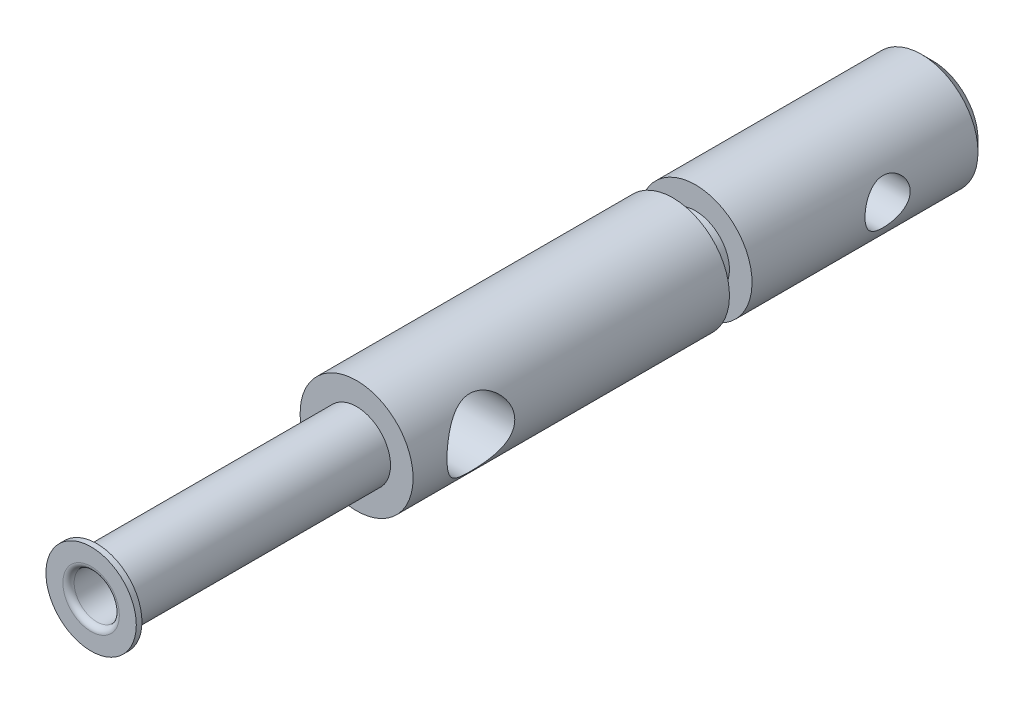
ISO-10303-21;
HEADER;
FILE_DESCRIPTION(('STEP AP214'),'2;1');
FILE_NAME('part.step','',(''),(''),'','','');
FILE_SCHEMA(('AUTOMOTIVE_DESIGN { 1 0 10303 214 1 1 1 1 }'));
ENDSEC;
DATA;
#1=APPLICATION_CONTEXT('core data for automotive mechanical design processes');
#2=APPLICATION_PROTOCOL_DEFINITION('international standard','automotive_design',2000,#1);
#3=PRODUCT_CONTEXT('',#1,'mechanical');
#4=PRODUCT('Part','Part','',(#3));
#5=PRODUCT_RELATED_PRODUCT_CATEGORY('part','',(#4));
#6=PRODUCT_DEFINITION_FORMATION('','',#4);
#7=PRODUCT_DEFINITION_CONTEXT('part definition',#1,'design');
#8=PRODUCT_DEFINITION('design','',#6,#7);
#9=PRODUCT_DEFINITION_SHAPE('','',#8);
#10=(LENGTH_UNIT() NAMED_UNIT(*) SI_UNIT(.MILLI.,.METRE.));
#11=(NAMED_UNIT(*) PLANE_ANGLE_UNIT() SI_UNIT($,.RADIAN.));
#12=(NAMED_UNIT(*) SI_UNIT($,.STERADIAN.) SOLID_ANGLE_UNIT());
#13=UNCERTAINTY_MEASURE_WITH_UNIT(LENGTH_MEASURE(1.E-05),#10,'distance_accuracy_value','');
#14=(GEOMETRIC_REPRESENTATION_CONTEXT(3) GLOBAL_UNCERTAINTY_ASSIGNED_CONTEXT((#13)) GLOBAL_UNIT_ASSIGNED_CONTEXT((#10,
#11,#12)) REPRESENTATION_CONTEXT('',''));
#15=CARTESIAN_POINT('',(0.,0.,0.));
#16=DIRECTION('',(0.,0.,1.));
#17=DIRECTION('',(1.,0.,0.));
#18=AXIS2_PLACEMENT_3D('',#15,#16,#17);
#19=CARTESIAN_POINT('',(0.,0.,51.));
#20=DIRECTION('',(0.,0.,-1.));
#21=DIRECTION('',(-1.,0.,0.));
#22=AXIS2_PLACEMENT_3D('',#19,#20,#21);
#23=CYLINDRICAL_SURFACE('',#22,5.);
#24=CARTESIAN_POINT('',(0.,0.,23.));
#25=DIRECTION('',(0.,0.,-1.));
#26=DIRECTION('',(0.,1.,0.));
#27=AXIS2_PLACEMENT_3D('',#24,#25,#26);
#28=CIRCLE('',#27,5.);
#29=CARTESIAN_POINT('',(0.,5.,23.));
#30=VERTEX_POINT('',#29);
#31=EDGE_CURVE('E181',#30,#30,#28,.T.);
#32=ORIENTED_EDGE('',*,*,#31,.F.);
#33=EDGE_LOOP('',(#32));
#34=FACE_BOUND('',#33,.T.);
#35=CARTESIAN_POINT('',(0.,0.,51.));
#36=DIRECTION('',(0.,0.,1.));
#37=DIRECTION('',(1.,0.,0.));
#38=AXIS2_PLACEMENT_3D('',#35,#36,#37);
#39=CIRCLE('',#38,5.);
#40=CARTESIAN_POINT('',(5.,0.,51.));
#41=VERTEX_POINT('',#40);
#42=EDGE_CURVE('E73',#41,#41,#39,.T.);
#43=ORIENTED_EDGE('',*,*,#42,.F.);
#44=EDGE_LOOP('',(#43));
#45=FACE_BOUND('',#44,.T.);
#46=CARTESIAN_POINT('',(5.,0.,42.));
#47=CARTESIAN_POINT('',(4.99999907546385,-0.076769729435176,42.0000010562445));
#48=CARTESIAN_POINT('',(4.99822567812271,-0.153562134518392,42.0029535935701));
#49=CARTESIAN_POINT('',(4.99118362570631,-0.30654848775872,42.0147142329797));
#50=CARTESIAN_POINT('',(4.98591292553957,-0.382742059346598,42.0235257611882));
#51=CARTESIAN_POINT('',(4.96499345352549,-0.609808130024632,42.0586485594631));
#52=CARTESIAN_POINT('',(4.94423772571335,-0.758981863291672,42.0936477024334));
#53=CARTESIAN_POINT('',(4.89123238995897,-1.04754167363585,42.1847727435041));
#54=CARTESIAN_POINT('',(4.8590397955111,-1.18697226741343,42.2407939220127));
#55=CARTESIAN_POINT('',(4.7859070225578,-1.45405042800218,42.371720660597));
#56=CARTESIAN_POINT('',(4.74496901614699,-1.58170090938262,42.4466215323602));
#57=CARTESIAN_POINT('',(4.65410731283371,-1.83260160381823,42.6195496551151));
#58=CARTESIAN_POINT('',(4.60373587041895,-1.95476885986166,42.7189073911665));
#59=CARTESIAN_POINT('',(4.50060875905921,-2.1817645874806,42.9349344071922));
#60=CARTESIAN_POINT('',(4.4478500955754,-2.28657046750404,43.0516258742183));
#61=CARTESIAN_POINT('',(4.33822134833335,-2.48890019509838,43.3158470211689));
#62=CARTESIAN_POINT('',(4.28164035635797,-2.58395539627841,43.4654035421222));
#63=CARTESIAN_POINT('',(4.17876602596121,-2.74722868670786,43.7816931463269));
#64=CARTESIAN_POINT('',(4.13245604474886,-2.81549033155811,43.9483977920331));
#65=CARTESIAN_POINT('',(4.06709259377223,-2.90881204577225,44.2531929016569));
#66=CARTESIAN_POINT('',(4.04415766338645,-2.94032394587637,44.3884719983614));
#67=CARTESIAN_POINT('',(4.01180616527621,-2.98432344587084,44.6636074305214));
#68=CARTESIAN_POINT('',(4.00237279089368,-2.99683469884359,44.803457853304));
#69=CARTESIAN_POINT('',(3.99841845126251,-3.0021101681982,45.0840229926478));
#70=CARTESIAN_POINT('',(4.00392674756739,-2.99483563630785,45.2247388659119));
#71=CARTESIAN_POINT('',(4.02906522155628,-2.96092124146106,45.5025575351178));
#72=CARTESIAN_POINT('',(4.04870602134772,-2.93426681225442,45.6396575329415));
#73=CARTESIAN_POINT('',(4.09906376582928,-2.86347831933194,45.9050605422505));
#74=CARTESIAN_POINT('',(4.12963433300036,-2.81957453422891,46.0334543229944));
#75=CARTESIAN_POINT('',(4.19854092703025,-2.71590167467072,46.2813897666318));
#76=CARTESIAN_POINT('',(4.23687979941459,-2.65612678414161,46.400928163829));
#77=CARTESIAN_POINT('',(4.32510698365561,-2.51035773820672,46.6499691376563));
#78=CARTESIAN_POINT('',(4.37584263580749,-2.42160671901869,46.7775599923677));
#79=CARTESIAN_POINT('',(4.47861022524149,-2.22582963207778,47.0173491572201));
#80=CARTESIAN_POINT('',(4.53064336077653,-2.11878609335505,47.1295325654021));
#81=CARTESIAN_POINT('',(4.63871766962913,-1.87159040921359,47.3512422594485));
#82=CARTESIAN_POINT('',(4.69430681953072,-1.72890315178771,47.4582193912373));
#83=CARTESIAN_POINT('',(4.77018325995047,-1.5006105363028,47.5992687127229));
#84=CARTESIAN_POINT('',(4.79423315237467,-1.42209821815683,47.6430641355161));
#85=CARTESIAN_POINT('',(4.83916496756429,-1.26074368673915,47.723718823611));
#86=CARTESIAN_POINT('',(4.86004883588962,-1.17790417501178,47.7605823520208));
#87=CARTESIAN_POINT('',(4.8968267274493,-1.01376371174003,47.8248114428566));
#88=CARTESIAN_POINT('',(4.91295100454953,-0.932690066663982,47.8526265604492));
#89=CARTESIAN_POINT('',(4.94139126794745,-0.767879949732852,47.9013339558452));
#90=CARTESIAN_POINT('',(4.95370938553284,-0.684144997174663,47.9222301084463));
#91=CARTESIAN_POINT('',(4.97416370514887,-0.514744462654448,47.9567718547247));
#92=CARTESIAN_POINT('',(4.98230296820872,-0.429080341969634,47.9704227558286));
#93=CARTESIAN_POINT('',(4.99415996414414,-0.256621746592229,47.9902661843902));
#94=CARTESIAN_POINT('',(4.99787831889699,-0.169827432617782,47.9964597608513));
#95=CARTESIAN_POINT('',(5.00179157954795,0.0673242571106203,48.0029926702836));
#96=CARTESIAN_POINT('',(4.99746512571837,0.218056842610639,47.9958115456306));
#97=CARTESIAN_POINT('',(4.97557955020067,0.515686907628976,47.9591544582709));
#98=CARTESIAN_POINT('',(4.95802069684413,0.662584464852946,47.9296789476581));
#99=CARTESIAN_POINT('',(4.91189447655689,0.945142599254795,47.8509115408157));
#100=CARTESIAN_POINT('',(4.88360514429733,1.08098954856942,47.802118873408));
#101=CARTESIAN_POINT('',(4.81827798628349,1.3425334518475,47.6866456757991));
#102=CARTESIAN_POINT('',(4.78123843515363,1.46822839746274,47.6199616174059));
#103=CARTESIAN_POINT('',(4.69690981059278,1.72001192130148,47.462885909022));
#104=CARTESIAN_POINT('',(4.64895602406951,1.84478813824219,47.3707523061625));
#105=CARTESIAN_POINT('',(4.54948534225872,2.0780522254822,47.1692172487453));
#106=CARTESIAN_POINT('',(4.49796434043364,2.18652085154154,47.0597957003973));
#107=CARTESIAN_POINT('',(4.38890846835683,2.39863988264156,46.8101792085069));
#108=CARTESIAN_POINT('',(4.33146483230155,2.4998203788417,46.667832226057));
#109=CARTESIAN_POINT('',(4.22432364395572,2.67690479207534,46.3655679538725));
#110=CARTESIAN_POINT('',(4.17461796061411,2.7528353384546,46.2056694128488));
#111=CARTESIAN_POINT('',(4.09969818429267,2.86285157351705,45.9075139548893));
#112=CARTESIAN_POINT('',(4.07151318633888,2.90243250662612,45.772039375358));
#113=CARTESIAN_POINT('',(4.02819211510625,2.96227327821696,45.4949358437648));
#114=CARTESIAN_POINT('',(4.01303795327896,2.98255990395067,45.3533157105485));
#115=CARTESIAN_POINT('',(3.99800893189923,3.00268261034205,45.0672461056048));
#116=CARTESIAN_POINT('',(3.99819152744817,3.00244179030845,44.9227880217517));
#117=CARTESIAN_POINT('',(4.01395435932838,2.98132945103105,44.6362111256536));
#118=CARTESIAN_POINT('',(4.02954296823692,2.96044671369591,44.4940936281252));
#119=CARTESIAN_POINT('',(4.07266369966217,2.90080351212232,44.2230231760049));
#120=CARTESIAN_POINT('',(4.09958421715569,2.86295284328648,44.0937658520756));
#121=CARTESIAN_POINT('',(4.1621100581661,2.77126473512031,43.8433254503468));
#122=CARTESIAN_POINT('',(4.19771865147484,2.71742127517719,43.722145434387));
#123=CARTESIAN_POINT('',(4.28025972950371,2.58578536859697,43.47136046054));
#124=CARTESIAN_POINT('',(4.32809142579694,2.50558518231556,43.3433184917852));
#125=CARTESIAN_POINT('',(4.42640286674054,2.32751213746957,43.1012391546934));
#126=CARTESIAN_POINT('',(4.47688476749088,2.22962472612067,42.9872134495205));
#127=CARTESIAN_POINT('',(4.5845123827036,2.00020353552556,42.7573011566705));
#128=CARTESIAN_POINT('',(4.64140045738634,1.86578571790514,42.6441501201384));
#129=CARTESIAN_POINT('',(4.74731429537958,1.57689277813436,42.4417920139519));
#130=CARTESIAN_POINT('',(4.79633723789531,1.42241049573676,42.3525935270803));
#131=CARTESIAN_POINT('',(4.85920558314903,1.18102189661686,42.2408755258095));
#132=CARTESIAN_POINT('',(4.87817139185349,1.10025014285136,42.2076640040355));
#133=CARTESIAN_POINT('',(4.91243413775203,0.935442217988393,42.1482278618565));
#134=CARTESIAN_POINT('',(4.9277332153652,0.851407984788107,42.1219991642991));
#135=CARTESIAN_POINT('',(4.95415527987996,0.681001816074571,42.0769905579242));
#136=CARTESIAN_POINT('',(4.9652904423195,0.594637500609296,42.0581889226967));
#137=CARTESIAN_POINT('',(4.98308318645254,0.420183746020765,42.028255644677));
#138=CARTESIAN_POINT('',(4.98974449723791,0.332095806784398,42.0171176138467));
#139=CARTESIAN_POINT('',(4.99603728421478,0.203123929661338,42.0066083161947));
#140=CARTESIAN_POINT('',(4.99752198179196,0.162556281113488,42.004131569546));
#141=CARTESIAN_POINT('',(4.99950360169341,0.0813278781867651,42.0008271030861));
#142=CARTESIAN_POINT('',(5.00000048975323,0.0406671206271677,41.9999994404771));
#143=CARTESIAN_POINT('',(5.,0.,42.));
#144=B_SPLINE_CURVE_WITH_KNOTS('',3,(#46,#47,#48,#49,#50,#51,#52,#53,#54,#55,#56,#57,#58,#59,
#60,#61,#62,#63,#64,#65,#66,#67,#68,#69,#70,#71,#72,#73,#74,#75,#76,#77,#78,#79,#80,#81,#82,#83,
#84,#85,#86,#87,#88,#89,#90,#91,#92,#93,#94,#95,#96,#97,#98,#99,#100,#101,#102,#103,#104,#105,
#106,#107,#108,#109,#110,#111,#112,#113,#114,#115,#116,#117,#118,#119,#120,#121,#122,#123,#124,
#125,#126,#127,#128,#129,#130,#131,#132,#133,#134,#135,#136,#137,#138,#139,#140,#141,#142,#143),
.UNSPECIFIED.,.T.,.F.,(4,2,2,2,2,2,2,2,2,2,2,2,2,2,2,2,2,2,2,2,2,2,2,2,2,2,2,2,2,2,2,2,2,2,2,2,
2,2,2,2,2,2,2,2,2,2,2,2,4),(0.,0.230263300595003,0.4606613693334,0.922002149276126,
1.38107466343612,1.84003329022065,2.33408870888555,2.8287820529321,3.38413315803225,
3.93857770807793,4.35913349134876,4.77916531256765,5.20002031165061,5.62119195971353,
6.03692224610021,6.45280509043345,6.94139679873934,7.43045779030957,7.98767605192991,
8.26653157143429,8.54521503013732,8.80648473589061,9.06760787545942,9.32853946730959,
9.58943435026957,10.0398406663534,10.490237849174,10.9296843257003,11.3692175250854,
11.8543559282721,12.3400624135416,12.889063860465,13.437484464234,13.8674843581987,
14.2968863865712,14.7278971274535,15.1591422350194,15.5696105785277,15.9802336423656,
16.4539008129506,16.927959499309,17.4794148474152,18.0310675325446,18.2988384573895,
18.5664526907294,18.8332781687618,19.0998809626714,19.221853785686,19.3438308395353),.UNSPECIFIED.);
#145=CARTESIAN_POINT('',(5.,0.,42.));
#146=VERTEX_POINT('',#145);
#147=EDGE_CURVE('E41',#146,#146,#144,.T.);
#148=ORIENTED_EDGE('',*,*,#147,.T.);
#149=EDGE_LOOP('',(#148));
#150=FACE_BOUND('',#149,.T.);
#151=CARTESIAN_POINT('',(-5.,0.,48.));
#152=CARTESIAN_POINT('',(-4.99999907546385,-0.0767697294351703,47.9999989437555));
#153=CARTESIAN_POINT('',(-4.99822567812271,-0.153562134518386,47.9970464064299));
#154=CARTESIAN_POINT('',(-4.99118362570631,-0.306548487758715,47.9852857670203));
#155=CARTESIAN_POINT('',(-4.98591292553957,-0.382742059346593,47.9764742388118));
#156=CARTESIAN_POINT('',(-4.96499345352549,-0.609808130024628,47.9413514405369));
#157=CARTESIAN_POINT('',(-4.94423772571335,-0.758981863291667,47.9063522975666));
#158=CARTESIAN_POINT('',(-4.89123238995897,-1.04754167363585,47.8152272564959));
#159=CARTESIAN_POINT('',(-4.8590397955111,-1.18697226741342,47.7592060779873));
#160=CARTESIAN_POINT('',(-4.7859070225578,-1.45405042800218,47.628279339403));
#161=CARTESIAN_POINT('',(-4.74496901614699,-1.58170090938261,47.5533784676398));
#162=CARTESIAN_POINT('',(-4.65410731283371,-1.83260160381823,47.3804503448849));
#163=CARTESIAN_POINT('',(-4.60373587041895,-1.95476885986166,47.2810926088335));
#164=CARTESIAN_POINT('',(-4.50060875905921,-2.1817645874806,47.0650655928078));
#165=CARTESIAN_POINT('',(-4.4478500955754,-2.28657046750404,46.9483741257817));
#166=CARTESIAN_POINT('',(-4.33822134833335,-2.48890019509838,46.6841529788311));
#167=CARTESIAN_POINT('',(-4.28164035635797,-2.5839553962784,46.5345964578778));
#168=CARTESIAN_POINT('',(-4.17876602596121,-2.74722868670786,46.2183068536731));
#169=CARTESIAN_POINT('',(-4.13245604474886,-2.81549033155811,46.0516022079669));
#170=CARTESIAN_POINT('',(-4.06709259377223,-2.90881204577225,45.7468070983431));
#171=CARTESIAN_POINT('',(-4.04415766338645,-2.94032394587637,45.6115280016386));
#172=CARTESIAN_POINT('',(-4.01180616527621,-2.98432344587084,45.3363925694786));
#173=CARTESIAN_POINT('',(-4.00237279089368,-2.99683469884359,45.196542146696));
#174=CARTESIAN_POINT('',(-3.99841845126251,-3.0021101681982,44.9159770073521));
#175=CARTESIAN_POINT('',(-4.00392674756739,-2.99483563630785,44.7752611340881));
#176=CARTESIAN_POINT('',(-4.02906522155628,-2.96092124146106,44.4974424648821));
#177=CARTESIAN_POINT('',(-4.04870602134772,-2.93426681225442,44.3603424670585));
#178=CARTESIAN_POINT('',(-4.09906376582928,-2.86347831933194,44.0949394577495));
#179=CARTESIAN_POINT('',(-4.12963433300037,-2.81957453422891,43.9665456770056));
#180=CARTESIAN_POINT('',(-4.19854092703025,-2.71590167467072,43.7186102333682));
#181=CARTESIAN_POINT('',(-4.23687979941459,-2.65612678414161,43.599071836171));
#182=CARTESIAN_POINT('',(-4.32510698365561,-2.51035773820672,43.3500308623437));
#183=CARTESIAN_POINT('',(-4.37584263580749,-2.42160671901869,43.2224400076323));
#184=CARTESIAN_POINT('',(-4.47861022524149,-2.22582963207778,42.9826508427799));
#185=CARTESIAN_POINT('',(-4.53064336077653,-2.11878609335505,42.8704674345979));
#186=CARTESIAN_POINT('',(-4.63871766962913,-1.87159040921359,42.6487577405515));
#187=CARTESIAN_POINT('',(-4.69430681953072,-1.72890315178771,42.5417806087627));
#188=CARTESIAN_POINT('',(-4.77018325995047,-1.5006105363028,42.4007312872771));
#189=CARTESIAN_POINT('',(-4.79423315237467,-1.42209821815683,42.3569358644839));
#190=CARTESIAN_POINT('',(-4.83916496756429,-1.26074368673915,42.276281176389));
#191=CARTESIAN_POINT('',(-4.86004883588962,-1.17790417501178,42.2394176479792));
#192=CARTESIAN_POINT('',(-4.8968267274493,-1.01376371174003,42.1751885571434));
#193=CARTESIAN_POINT('',(-4.91295100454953,-0.932690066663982,42.1473734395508));
#194=CARTESIAN_POINT('',(-4.94139126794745,-0.767879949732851,42.0986660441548));
#195=CARTESIAN_POINT('',(-4.95370938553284,-0.684144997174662,42.0777698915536));
#196=CARTESIAN_POINT('',(-4.97416370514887,-0.514744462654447,42.0432281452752));
#197=CARTESIAN_POINT('',(-4.98230296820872,-0.429080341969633,42.0295772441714));
#198=CARTESIAN_POINT('',(-4.99415996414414,-0.256621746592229,42.0097338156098));
#199=CARTESIAN_POINT('',(-4.99787831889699,-0.169827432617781,42.0035402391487));
#200=CARTESIAN_POINT('',(-5.00179157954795,0.0673242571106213,41.9970073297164));
#201=CARTESIAN_POINT('',(-4.99746512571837,0.21805684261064,42.0041884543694));
#202=CARTESIAN_POINT('',(-4.97557955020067,0.515686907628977,42.0408455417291));
#203=CARTESIAN_POINT('',(-4.95802069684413,0.662584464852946,42.0703210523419));
#204=CARTESIAN_POINT('',(-4.91189447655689,0.945142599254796,42.1490884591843));
#205=CARTESIAN_POINT('',(-4.88360514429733,1.08098954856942,42.197881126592));
#206=CARTESIAN_POINT('',(-4.81827798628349,1.34253345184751,42.3133543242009));
#207=CARTESIAN_POINT('',(-4.78123843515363,1.46822839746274,42.3800383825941));
#208=CARTESIAN_POINT('',(-4.69690981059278,1.72001192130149,42.537114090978));
#209=CARTESIAN_POINT('',(-4.64895602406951,1.84478813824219,42.6292476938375));
#210=CARTESIAN_POINT('',(-4.54948534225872,2.0780522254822,42.8307827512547));
#211=CARTESIAN_POINT('',(-4.49796434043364,2.18652085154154,42.9402042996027));
#212=CARTESIAN_POINT('',(-4.38890846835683,2.39863988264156,43.1898207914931));
#213=CARTESIAN_POINT('',(-4.33146483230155,2.4998203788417,43.332167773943));
#214=CARTESIAN_POINT('',(-4.22432364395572,2.67690479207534,43.6344320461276));
#215=CARTESIAN_POINT('',(-4.17461796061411,2.7528353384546,43.7943305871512));
#216=CARTESIAN_POINT('',(-4.09969818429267,2.86285157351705,44.0924860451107));
#217=CARTESIAN_POINT('',(-4.07151318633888,2.90243250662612,44.227960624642));
#218=CARTESIAN_POINT('',(-4.02819211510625,2.96227327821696,44.5050641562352));
#219=CARTESIAN_POINT('',(-4.01303795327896,2.98255990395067,44.6466842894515));
#220=CARTESIAN_POINT('',(-3.99800893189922,3.00268261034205,44.9327538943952));
#221=CARTESIAN_POINT('',(-3.99819152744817,3.00244179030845,45.0772119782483));
#222=CARTESIAN_POINT('',(-4.01395435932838,2.98132945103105,45.3637888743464));
#223=CARTESIAN_POINT('',(-4.02954296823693,2.96044671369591,45.5059063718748));
#224=CARTESIAN_POINT('',(-4.07266369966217,2.90080351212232,45.7769768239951));
#225=CARTESIAN_POINT('',(-4.0995842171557,2.86295284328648,45.9062341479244));
#226=CARTESIAN_POINT('',(-4.1621100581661,2.77126473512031,46.1566745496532));
#227=CARTESIAN_POINT('',(-4.19771865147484,2.71742127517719,46.277854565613));
#228=CARTESIAN_POINT('',(-4.28025972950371,2.58578536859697,46.52863953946));
#229=CARTESIAN_POINT('',(-4.32809142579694,2.50558518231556,46.6566815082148));
#230=CARTESIAN_POINT('',(-4.42640286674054,2.32751213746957,46.8987608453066));
#231=CARTESIAN_POINT('',(-4.47688476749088,2.22962472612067,47.0127865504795));
#232=CARTESIAN_POINT('',(-4.5845123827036,2.00020353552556,47.2426988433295));
#233=CARTESIAN_POINT('',(-4.64140045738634,1.86578571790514,47.3558498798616));
#234=CARTESIAN_POINT('',(-4.74731429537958,1.57689277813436,47.5582079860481));
#235=CARTESIAN_POINT('',(-4.79633723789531,1.42241049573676,47.6474064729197));
#236=CARTESIAN_POINT('',(-4.85920558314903,1.18102189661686,47.7591244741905));
#237=CARTESIAN_POINT('',(-4.87817139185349,1.10025014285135,47.7923359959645));
#238=CARTESIAN_POINT('',(-4.91243413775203,0.935442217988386,47.8517721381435));
#239=CARTESIAN_POINT('',(-4.9277332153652,0.8514079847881,47.8780008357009));
#240=CARTESIAN_POINT('',(-4.95415527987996,0.681001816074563,47.9230094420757));
#241=CARTESIAN_POINT('',(-4.9652904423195,0.594637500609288,47.9418110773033));
#242=CARTESIAN_POINT('',(-4.98308318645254,0.420183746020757,47.971744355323));
#243=CARTESIAN_POINT('',(-4.98974449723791,0.332095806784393,47.9828823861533));
#244=CARTESIAN_POINT('',(-4.99603728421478,0.203123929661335,47.9933916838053));
#245=CARTESIAN_POINT('',(-4.99752198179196,0.162556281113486,47.995868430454));
#246=CARTESIAN_POINT('',(-4.99950360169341,0.0813278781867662,47.9991728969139));
#247=CARTESIAN_POINT('',(-5.00000048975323,0.040667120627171,48.0000005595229));
#248=CARTESIAN_POINT('',(-5.,0.,48.));
#249=B_SPLINE_CURVE_WITH_KNOTS('',3,(#151,#152,#153,#154,#155,#156,#157,#158,#159,#160,#161,
#162,#163,#164,#165,#166,#167,#168,#169,#170,#171,#172,#173,#174,#175,#176,#177,#178,#179,#180,
#181,#182,#183,#184,#185,#186,#187,#188,#189,#190,#191,#192,#193,#194,#195,#196,#197,#198,#199,
#200,#201,#202,#203,#204,#205,#206,#207,#208,#209,#210,#211,#212,#213,#214,#215,#216,#217,#218,
#219,#220,#221,#222,#223,#224,#225,#226,#227,#228,#229,#230,#231,#232,#233,#234,#235,#236,#237,
#238,#239,#240,#241,#242,#243,#244,#245,#246,#247,#248),.UNSPECIFIED.,.T.,.F.,(4,2,2,2,2,2,2,2,
2,2,2,2,2,2,2,2,2,2,2,2,2,2,2,2,2,2,2,2,2,2,2,2,2,2,2,2,2,2,2,2,2,2,2,2,2,2,2,2,4),(0.,
0.230263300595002,0.4606613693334,0.922002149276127,1.38107466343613,1.84003329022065,
2.33408870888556,2.82878205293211,3.38413315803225,3.93857770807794,4.35913349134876,
4.77916531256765,5.20002031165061,5.62119195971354,6.03692224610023,6.45280509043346,
6.94139679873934,7.43045779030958,7.98767605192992,8.2665315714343,8.54521503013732,
8.80648473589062,9.06760787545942,9.3285394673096,9.58943435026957,10.0398406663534,
10.490237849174,10.9296843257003,11.3692175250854,11.8543559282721,12.3400624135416,
12.889063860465,13.437484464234,13.8674843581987,14.2968863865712,14.7278971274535,
15.1591422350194,15.5696105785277,15.9802336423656,16.4539008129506,16.927959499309,
17.4794148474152,18.0310675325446,18.2988384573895,18.5664526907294,18.8332781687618,
19.0998809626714,19.221853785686,19.3438308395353),.UNSPECIFIED.);
#250=CARTESIAN_POINT('',(-5.,0.,48.));
#251=VERTEX_POINT('',#250);
#252=EDGE_CURVE('E11',#251,#251,#249,.T.);
#253=ORIENTED_EDGE('',*,*,#252,.T.);
#254=EDGE_LOOP('',(#253));
#255=FACE_BOUND('',#254,.T.);
#256=ADVANCED_FACE('F30',(#34,#45,#150,#255),#23,.T.);
#257=CARTESIAN_POINT('',(0.,0.,51.));
#258=DIRECTION('',(0.,0.,1.));
#259=DIRECTION('',(1.,0.,0.));
#260=AXIS2_PLACEMENT_3D('',#257,#258,#259);
#261=PLANE('',#260);
#262=ORIENTED_EDGE('',*,*,#42,.T.);
#263=EDGE_LOOP('',(#262));
#264=FACE_BOUND('',#263,.T.);
#265=CARTESIAN_POINT('',(0.,0.,51.));
#266=DIRECTION('',(0.,0.,1.));
#267=DIRECTION('',(1.,0.,0.));
#268=AXIS2_PLACEMENT_3D('',#265,#266,#267);
#269=CIRCLE('',#268,3.);
#270=CARTESIAN_POINT('',(3.,0.,51.));
#271=VERTEX_POINT('',#270);
#272=EDGE_CURVE('E67',#271,#271,#269,.T.);
#273=ORIENTED_EDGE('',*,*,#272,.F.);
#274=EDGE_LOOP('',(#273));
#275=FACE_BOUND('',#274,.T.);
#276=ADVANCED_FACE('F128',(#264,#275),#261,.T.);
#277=CARTESIAN_POINT('',(0.,0.,74.));
#278=DIRECTION('',(0.,0.,-1.));
#279=DIRECTION('',(-1.,0.,0.));
#280=AXIS2_PLACEMENT_3D('',#277,#278,#279);
#281=CYLINDRICAL_SURFACE('',#280,3.);
#282=CARTESIAN_POINT('',(0.,0.,74.));
#283=DIRECTION('',(0.,0.,1.));
#284=DIRECTION('',(1.,0.,0.));
#285=AXIS2_PLACEMENT_3D('',#282,#283,#284);
#286=CIRCLE('',#285,3.);
#287=CARTESIAN_POINT('',(3.,0.,74.));
#288=VERTEX_POINT('',#287);
#289=EDGE_CURVE('E70',#288,#288,#286,.T.);
#290=ORIENTED_EDGE('',*,*,#289,.F.);
#291=EDGE_LOOP('',(#290));
#292=FACE_BOUND('',#291,.T.);
#293=ORIENTED_EDGE('',*,*,#272,.T.);
#294=EDGE_LOOP('',(#293));
#295=FACE_BOUND('',#294,.T.);
#296=ADVANCED_FACE('F118',(#292,#295),#281,.T.);
#297=CARTESIAN_POINT('',(0.,0.,74.));
#298=DIRECTION('',(0.,0.,1.));
#299=DIRECTION('',(1.,0.,0.));
#300=AXIS2_PLACEMENT_3D('',#297,#298,#299);
#301=PLANE('',#300);
#302=CARTESIAN_POINT('',(0.,0.,74.));
#303=DIRECTION('',(0.,0.,1.));
#304=DIRECTION('',(1.,0.,0.));
#305=AXIS2_PLACEMENT_3D('',#302,#303,#304);
#306=CIRCLE('',#305,4.);
#307=CARTESIAN_POINT('',(4.,0.,74.));
#308=VERTEX_POINT('',#307);
#309=EDGE_CURVE('E54',#308,#308,#306,.T.);
#310=ORIENTED_EDGE('',*,*,#309,.F.);
#311=EDGE_LOOP('',(#310));
#312=FACE_BOUND('',#311,.T.);
#313=ORIENTED_EDGE('',*,*,#289,.T.);
#314=EDGE_LOOP('',(#313));
#315=FACE_BOUND('',#314,.T.);
#316=ADVANCED_FACE('F114',(#312,#315),#301,.F.);
#317=CARTESIAN_POINT('',(0.,0.,74.5));
#318=DIRECTION('',(0.,0.,-1.));
#319=DIRECTION('',(-1.,0.,0.));
#320=AXIS2_PLACEMENT_3D('',#317,#318,#319);
#321=CYLINDRICAL_SURFACE('',#320,4.);
#322=CARTESIAN_POINT('',(0.,0.,74.5));
#323=DIRECTION('',(0.,0.,1.));
#324=DIRECTION('',(1.,0.,0.));
#325=AXIS2_PLACEMENT_3D('',#322,#323,#324);
#326=CIRCLE('',#325,4.);
#327=CARTESIAN_POINT('',(4.,0.,74.5));
#328=VERTEX_POINT('',#327);
#329=EDGE_CURVE('E58',#328,#328,#326,.T.);
#330=ORIENTED_EDGE('',*,*,#329,.F.);
#331=EDGE_LOOP('',(#330));
#332=FACE_BOUND('',#331,.T.);
#333=ORIENTED_EDGE('',*,*,#309,.T.);
#334=EDGE_LOOP('',(#333));
#335=FACE_BOUND('',#334,.T.);
#336=ADVANCED_FACE('F117',(#332,#335),#321,.T.);
#337=CARTESIAN_POINT('',(0.,0.,74.5));
#338=DIRECTION('',(0.,0.,1.));
#339=DIRECTION('',(1.,0.,0.));
#340=AXIS2_PLACEMENT_3D('',#337,#338,#339);
#341=PLANE('',#340);
#342=CARTESIAN_POINT('',(0.,0.,74.5));
#343=DIRECTION('',(0.,0.,1.));
#344=DIRECTION('',(1.,0.,0.));
#345=AXIS2_PLACEMENT_3D('',#342,#343,#344);
#346=CIRCLE('',#345,2.5);
#347=CARTESIAN_POINT('',(2.5,0.,74.5));
#348=VERTEX_POINT('',#347);
#349=EDGE_CURVE('E85',#348,#348,#346,.F.);
#350=ORIENTED_EDGE('',*,*,#349,.T.);
#351=EDGE_LOOP('',(#350));
#352=FACE_BOUND('',#351,.T.);
#353=ORIENTED_EDGE('',*,*,#329,.T.);
#354=EDGE_LOOP('',(#353));
#355=FACE_BOUND('',#354,.T.);
#356=ADVANCED_FACE('F112',(#352,#355),#341,.T.);
#357=CARTESIAN_POINT('',(0.,0.,74.5));
#358=DIRECTION('',(0.,0.,1.));
#359=DIRECTION('',(1.,0.,0.));
#360=AXIS2_PLACEMENT_3D('',#357,#358,#359);
#361=CYLINDRICAL_SURFACE('',#360,2.);
#362=CARTESIAN_POINT('',(0.,0.,74.));
#363=DIRECTION('',(0.,0.,1.));
#364=DIRECTION('',(1.,0.,0.));
#365=AXIS2_PLACEMENT_3D('',#362,#363,#364);
#366=CIRCLE('',#365,2.);
#367=CARTESIAN_POINT('',(2.,0.,74.));
#368=VERTEX_POINT('',#367);
#369=EDGE_CURVE('E82',#368,#368,#366,.T.);
#370=ORIENTED_EDGE('',*,*,#369,.T.);
#371=EDGE_LOOP('',(#370));
#372=FACE_BOUND('',#371,.T.);
#373=CARTESIAN_POINT('',(0.,0.,69.5));
#374=DIRECTION('',(0.,0.,1.));
#375=DIRECTION('',(1.,0.,0.));
#376=AXIS2_PLACEMENT_3D('',#373,#374,#375);
#377=CIRCLE('',#376,2.);
#378=CARTESIAN_POINT('',(2.,0.,69.5));
#379=VERTEX_POINT('',#378);
#380=EDGE_CURVE('E52',#379,#379,#377,.T.);
#381=ORIENTED_EDGE('',*,*,#380,.F.);
#382=EDGE_LOOP('',(#381));
#383=FACE_BOUND('',#382,.T.);
#384=ADVANCED_FACE('F48',(#372,#383),#361,.F.);
#385=CARTESIAN_POINT('',(0.,0.,69.5));
#386=DIRECTION('',(0.,0.,1.));
#387=DIRECTION('',(1.,0.,0.));
#388=AXIS2_PLACEMENT_3D('',#385,#386,#387);
#389=CONICAL_SURFACE('',#388,2.,1.02974425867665);
#390=CARTESIAN_POINT('',(0.,0.,68.2982787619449));
#391=VERTEX_POINT('',#390);
#392=VERTEX_LOOP('',#391);
#393=FACE_BOUND('',#392,.T.);
#394=ORIENTED_EDGE('',*,*,#380,.T.);
#395=EDGE_LOOP('',(#394));
#396=FACE_BOUND('',#395,.T.);
#397=ADVANCED_FACE('F44',(#393,#396),#389,.F.);
#398=CARTESIAN_POINT('',(0.,0.,74.));
#399=DIRECTION('',(0.,0.,1.));
#400=DIRECTION('',(1.,0.,0.));
#401=AXIS2_PLACEMENT_3D('',#398,#399,#400);
#402=TOROIDAL_SURFACE('',#401,2.5,0.5);
#403=ORIENTED_EDGE('',*,*,#349,.F.);
#404=EDGE_LOOP('',(#403));
#405=FACE_BOUND('',#404,.T.);
#406=ORIENTED_EDGE('',*,*,#369,.F.);
#407=EDGE_LOOP('',(#406));
#408=FACE_BOUND('',#407,.T.);
#409=ADVANCED_FACE('F47',(#405,#408),#402,.T.);
#410=CARTESIAN_POINT('',(-5.,0.,45.));
#411=DIRECTION('',(1.,0.,0.));
#412=DIRECTION('',(0.,0.,-1.));
#413=AXIS2_PLACEMENT_3D('',#410,#411,#412);
#414=CYLINDRICAL_SURFACE('',#413,3.);
#415=ORIENTED_EDGE('',*,*,#147,.F.);
#416=EDGE_LOOP('',(#415));
#417=FACE_BOUND('',#416,.T.);
#418=ORIENTED_EDGE('',*,*,#252,.F.);
#419=EDGE_LOOP('',(#418));
#420=FACE_BOUND('',#419,.T.);
#421=ADVANCED_FACE('F103',(#417,#420),#414,.F.);
#422=CARTESIAN_POINT('',(0.,5.,23.));
#423=DIRECTION('',(0.,0.,1.));
#424=DIRECTION('',(0.,-1.,0.));
#425=AXIS2_PLACEMENT_3D('',#422,#423,#424);
#426=PLANE('',#425);
#427=CARTESIAN_POINT('',(0.,0.,23.));
#428=DIRECTION('',(0.,0.,-1.));
#429=DIRECTION('',(0.,1.,0.));
#430=AXIS2_PLACEMENT_3D('',#427,#428,#429);
#431=CIRCLE('',#430,3.);
#432=CARTESIAN_POINT('',(0.,3.,23.));
#433=VERTEX_POINT('',#432);
#434=EDGE_CURVE('E55',#433,#433,#431,.T.);
#435=ORIENTED_EDGE('',*,*,#434,.F.);
#436=EDGE_LOOP('',(#435));
#437=FACE_BOUND('',#436,.T.);
#438=ORIENTED_EDGE('',*,*,#31,.T.);
#439=EDGE_LOOP('',(#438));
#440=FACE_BOUND('',#439,.T.);
#441=ADVANCED_FACE('F155',(#437,#440),#426,.F.);
#442=CARTESIAN_POINT('',(0.,0.,0.));
#443=DIRECTION('',(0.,0.,-1.));
#444=DIRECTION('',(0.,1.,0.));
#445=AXIS2_PLACEMENT_3D('',#442,#443,#444);
#446=CYLINDRICAL_SURFACE('',#445,3.);
#447=CARTESIAN_POINT('',(0.,0.,21.));
#448=DIRECTION('',(0.,0.,-1.));
#449=DIRECTION('',(0.,1.,0.));
#450=AXIS2_PLACEMENT_3D('',#447,#448,#449);
#451=CIRCLE('',#450,3.);
#452=CARTESIAN_POINT('',(0.,3.,21.));
#453=VERTEX_POINT('',#452);
#454=EDGE_CURVE('E61',#453,#453,#451,.T.);
#455=ORIENTED_EDGE('',*,*,#454,.F.);
#456=EDGE_LOOP('',(#455));
#457=FACE_BOUND('',#456,.T.);
#458=ORIENTED_EDGE('',*,*,#434,.T.);
#459=EDGE_LOOP('',(#458));
#460=FACE_BOUND('',#459,.T.);
#461=ADVANCED_FACE('F160',(#457,#460),#446,.T.);
#462=CARTESIAN_POINT('',(0.,5.,21.));
#463=DIRECTION('',(0.,0.,-1.));
#464=DIRECTION('',(0.,1.,0.));
#465=AXIS2_PLACEMENT_3D('',#462,#463,#464);
#466=PLANE('',#465);
#467=CARTESIAN_POINT('',(0.,0.,21.));
#468=DIRECTION('',(0.,0.,-1.));
#469=DIRECTION('',(0.,1.,0.));
#470=AXIS2_PLACEMENT_3D('',#467,#468,#469);
#471=CIRCLE('',#470,5.);
#472=CARTESIAN_POINT('',(0.,5.,21.));
#473=VERTEX_POINT('',#472);
#474=EDGE_CURVE('E179',#473,#473,#471,.T.);
#475=ORIENTED_EDGE('',*,*,#474,.F.);
#476=EDGE_LOOP('',(#475));
#477=FACE_BOUND('',#476,.T.);
#478=ORIENTED_EDGE('',*,*,#454,.T.);
#479=EDGE_LOOP('',(#478));
#480=FACE_BOUND('',#479,.T.);
#481=ADVANCED_FACE('F135',(#477,#480),#466,.F.);
#482=CARTESIAN_POINT('',(0.,0.,0.));
#483=DIRECTION('',(0.,0.,1.));
#484=DIRECTION('',(1.,0.,0.));
#485=AXIS2_PLACEMENT_3D('',#482,#483,#484);
#486=PLANE('',#485);
#487=CARTESIAN_POINT('',(0.,0.,0.));
#488=DIRECTION('',(0.,0.,1.));
#489=DIRECTION('',(1.,0.,0.));
#490=AXIS2_PLACEMENT_3D('',#487,#488,#489);
#491=CIRCLE('',#490,4.00000000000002);
#492=CARTESIAN_POINT('',(4.00000000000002,0.,0.));
#493=VERTEX_POINT('',#492);
#494=EDGE_CURVE('E79',#493,#493,#491,.F.);
#495=ORIENTED_EDGE('',*,*,#494,.T.);
#496=EDGE_LOOP('',(#495));
#497=FACE_BOUND('',#496,.T.);
#498=ADVANCED_FACE('F132',(#497),#486,.F.);
#499=CARTESIAN_POINT('',(0.,0.,0.999999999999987));
#500=DIRECTION('',(0.,0.,1.));
#501=DIRECTION('',(1.,0.,0.));
#502=AXIS2_PLACEMENT_3D('',#499,#500,#501);
#503=CONICAL_SURFACE('',#502,5.,0.785398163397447);
#504=ORIENTED_EDGE('',*,*,#494,.F.);
#505=EDGE_LOOP('',(#504));
#506=FACE_BOUND('',#505,.T.);
#507=CARTESIAN_POINT('',(0.,0.,0.999999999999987));
#508=DIRECTION('',(0.,0.,1.));
#509=DIRECTION('',(1.,0.,0.));
#510=AXIS2_PLACEMENT_3D('',#507,#508,#509);
#511=CIRCLE('',#510,5.);
#512=CARTESIAN_POINT('',(5.,0.,0.999999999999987));
#513=VERTEX_POINT('',#512);
#514=EDGE_CURVE('E76',#513,#513,#511,.T.);
#515=ORIENTED_EDGE('',*,*,#514,.F.);
#516=EDGE_LOOP('',(#515));
#517=FACE_BOUND('',#516,.T.);
#518=ADVANCED_FACE('F101',(#506,#517),#503,.T.);
#519=CARTESIAN_POINT('',(-5.,0.,9.));
#520=DIRECTION('',(1.,0.,0.));
#521=DIRECTION('',(0.,0.,-1.));
#522=AXIS2_PLACEMENT_3D('',#519,#520,#521);
#523=CYLINDRICAL_SURFACE('',#522,2.);
#524=CARTESIAN_POINT('',(5.,0.,7.));
#525=CARTESIAN_POINT('',(4.99999271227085,-0.107493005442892,7.00000985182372));
#526=CARTESIAN_POINT('',(4.99649294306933,-0.215172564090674,7.00871775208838));
#527=CARTESIAN_POINT('',(4.98283453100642,-0.427496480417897,7.04324770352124));
#528=CARTESIAN_POINT('',(4.97265778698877,-0.532131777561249,7.06911627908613));
#529=CARTESIAN_POINT('',(4.94674209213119,-0.734953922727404,7.13687607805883));
#530=CARTESIAN_POINT('',(4.93102136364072,-0.83316066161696,7.17871484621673));
#531=CARTESIAN_POINT('',(4.89556610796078,-1.02107197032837,7.27701917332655));
#532=CARTESIAN_POINT('',(4.87583297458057,-1.11077947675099,7.33347965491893));
#533=CARTESIAN_POINT('',(4.83330886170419,-1.2835010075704,7.46223549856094));
#534=CARTESIAN_POINT('',(4.81042296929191,-1.36606227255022,7.53510665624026));
#535=CARTESIAN_POINT('',(4.76460576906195,-1.51817500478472,7.69340000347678));
#536=CARTESIAN_POINT('',(4.74167444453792,-1.58772010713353,7.77882829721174));
#537=CARTESIAN_POINT('',(4.69722791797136,-1.71487456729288,7.96442807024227));
#538=CARTESIAN_POINT('',(4.67582115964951,-1.77181498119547,8.0650864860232));
#539=CARTESIAN_POINT('',(4.63833647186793,-1.86775471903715,8.27553639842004));
#540=CARTESIAN_POINT('',(4.62225601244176,-1.90676256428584,8.38532352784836));
#541=CARTESIAN_POINT('',(4.59826357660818,-1.96389882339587,8.6057123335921));
#542=CARTESIAN_POINT('',(4.59001420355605,-1.98289396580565,8.71605123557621));
#543=CARTESIAN_POINT('',(4.58164004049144,-2.00217296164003,8.93863499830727));
#544=CARTESIAN_POINT('',(4.58151125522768,-2.00246601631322,9.05087889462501));
#545=CARTESIAN_POINT('',(4.58910500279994,-1.98498936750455,9.26575667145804));
#546=CARTESIAN_POINT('',(4.5962817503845,-1.96847531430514,9.36851571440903));
#547=CARTESIAN_POINT('',(4.61676187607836,-1.91994688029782,9.56965955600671));
#548=CARTESIAN_POINT('',(4.63006632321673,-1.88792979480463,9.66804358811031));
#549=CARTESIAN_POINT('',(4.6615948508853,-1.80869473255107,9.86001783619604));
#550=CARTESIAN_POINT('',(4.67991379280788,-1.76117986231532,9.95346923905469));
#551=CARTESIAN_POINT('',(4.7193811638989,-1.65250646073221,10.1314158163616));
#552=CARTESIAN_POINT('',(4.74053065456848,-1.59134280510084,10.2159076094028));
#553=CARTESIAN_POINT('',(4.78526736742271,-1.45155059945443,10.380409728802));
#554=CARTESIAN_POINT('',(4.80891664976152,-1.37193746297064,10.459568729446));
#555=CARTESIAN_POINT('',(4.85459824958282,-1.20031442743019,10.603684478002));
#556=CARTESIAN_POINT('',(4.87663024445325,-1.10830206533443,10.6686383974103));
#557=CARTESIAN_POINT('',(4.91714681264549,-0.912077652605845,10.7836174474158));
#558=CARTESIAN_POINT('',(4.93555270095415,-0.807660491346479,10.8333222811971));
#559=CARTESIAN_POINT('',(4.96614828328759,-0.591023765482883,10.9141678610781));
#560=CARTESIAN_POINT('',(4.97834113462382,-0.478808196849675,10.9453180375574));
#561=CARTESIAN_POINT('',(4.99456139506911,-0.25689588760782,10.9864482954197));
#562=CARTESIAN_POINT('',(4.99902945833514,-0.147443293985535,10.9975724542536));
#563=CARTESIAN_POINT('',(5.00068478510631,0.0718453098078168,11.0017131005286));
#564=CARTESIAN_POINT('',(4.99787393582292,0.181681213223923,10.9947342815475));
#565=CARTESIAN_POINT('',(4.98557567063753,0.393432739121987,10.963708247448));
#566=CARTESIAN_POINT('',(4.97639391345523,0.495482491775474,10.940442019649));
#567=CARTESIAN_POINT('',(4.952594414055,0.69413542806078,10.8785642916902));
#568=CARTESIAN_POINT('',(4.93797597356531,0.790737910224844,10.8399508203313));
#569=CARTESIAN_POINT('',(4.90416594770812,0.979078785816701,10.7472150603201));
#570=CARTESIAN_POINT('',(4.88484815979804,1.0705780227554,10.6926545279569));
#571=CARTESIAN_POINT('',(4.84373364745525,1.24344359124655,10.5700596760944));
#572=CARTESIAN_POINT('',(4.82193593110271,1.32480584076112,10.5020199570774));
#573=CARTESIAN_POINT('',(4.77645117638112,1.48072304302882,10.3491299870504));
#574=CARTESIAN_POINT('',(4.75273441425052,1.55447393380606,10.2634664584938));
#575=CARTESIAN_POINT('',(4.70741672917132,1.68675119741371,10.0805599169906));
#576=CARTESIAN_POINT('',(4.68581615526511,1.74527506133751,9.98331499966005));
#577=CARTESIAN_POINT('',(4.64714299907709,1.84580750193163,9.7785383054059));
#578=CARTESIAN_POINT('',(4.63011630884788,1.88765059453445,9.67091600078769));
#579=CARTESIAN_POINT('',(4.60323673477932,1.9522962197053,9.44926634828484));
#580=CARTESIAN_POINT('',(4.59337855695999,1.97511280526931,9.33524379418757));
#581=CARTESIAN_POINT('',(4.58271759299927,1.9997156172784,9.11287209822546));
#582=CARTESIAN_POINT('',(4.58131421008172,2.00289708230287,9.00470516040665));
#583=CARTESIAN_POINT('',(4.58614836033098,1.99180315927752,8.78945514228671));
#584=CARTESIAN_POINT('',(4.59238492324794,1.97752998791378,8.68237192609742));
#585=CARTESIAN_POINT('',(4.61126649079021,1.93307136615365,8.47666781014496));
#586=CARTESIAN_POINT('',(4.62364831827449,1.90353749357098,8.377879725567));
#587=CARTESIAN_POINT('',(4.65324001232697,1.83000544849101,8.18662137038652));
#588=CARTESIAN_POINT('',(4.67045121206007,1.78600328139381,8.09415285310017));
#589=CARTESIAN_POINT('',(4.70898609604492,1.68187276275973,7.91239038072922));
#590=CARTESIAN_POINT('',(4.73048882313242,1.62096533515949,7.82358132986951));
#591=CARTESIAN_POINT('',(4.77463804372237,1.4858921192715,7.65700668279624));
#592=CARTESIAN_POINT('',(4.79728488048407,1.41172233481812,7.57924442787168));
#593=CARTESIAN_POINT('',(4.84293567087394,1.24650550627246,7.43179714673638));
#594=CARTESIAN_POINT('',(4.86586757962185,1.15467600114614,7.36296269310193));
#595=CARTESIAN_POINT('',(4.90800406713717,0.959900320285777,7.24166295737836));
#596=CARTESIAN_POINT('',(4.92720691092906,0.856949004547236,7.18920528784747));
#597=CARTESIAN_POINT('',(4.95939714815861,0.644738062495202,7.10337778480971));
#598=CARTESIAN_POINT('',(4.97249363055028,0.535631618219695,7.06967067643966));
#599=CARTESIAN_POINT('',(4.99144306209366,0.312876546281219,7.02136087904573));
#600=CARTESIAN_POINT('',(4.99731899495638,0.199243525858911,7.0066975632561));
#601=CARTESIAN_POINT('',(4.99975899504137,0.0569122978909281,7.00060461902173));
#602=CARTESIAN_POINT('',(5.00000192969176,0.028462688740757,6.9999973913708));
#603=CARTESIAN_POINT('',(5.,0.,7.));
#604=B_SPLINE_CURVE_WITH_KNOTS('',3,(#524,#525,#526,#527,#528,#529,#530,#531,#532,#533,#534,
#535,#536,#537,#538,#539,#540,#541,#542,#543,#544,#545,#546,#547,#548,#549,#550,#551,#552,#553,
#554,#555,#556,#557,#558,#559,#560,#561,#562,#563,#564,#565,#566,#567,#568,#569,#570,#571,#572,
#573,#574,#575,#576,#577,#578,#579,#580,#581,#582,#583,#584,#585,#586,#587,#588,#589,#590,#591,
#592,#593,#594,#595,#596,#597,#598,#599,#600,#601,#602,#603),.UNSPECIFIED.,.T.,.F.,(4,2,2,2,2,2,
2,2,2,2,2,2,2,2,2,2,2,2,2,2,2,2,2,2,2,2,2,2,2,2,2,2,2,2,2,2,2,2,2,4),(0.,0.322402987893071,
0.645683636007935,0.967911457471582,1.29002753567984,1.62597381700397,1.96208394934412,
2.31315258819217,2.66405423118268,2.99904105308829,3.33386306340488,3.64538328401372,
3.95695787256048,4.27489126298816,4.59294421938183,4.93558349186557,5.27829092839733,
5.62776913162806,5.97706956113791,6.30569184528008,6.63422893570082,6.94800455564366,
7.26182048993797,7.58523513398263,7.90877959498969,8.25368474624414,8.59864669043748,
8.94695045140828,9.29499672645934,9.61799673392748,9.94095572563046,10.2511431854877,
10.5614163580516,10.8894546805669,11.2175920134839,11.5670042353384,11.9165786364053,
12.2596430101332,12.6016125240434,12.686980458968),.UNSPECIFIED.);
#605=CARTESIAN_POINT('',(5.,0.,7.));
#606=VERTEX_POINT('',#605);
#607=EDGE_CURVE('E88',#606,#606,#604,.T.);
#608=ORIENTED_EDGE('',*,*,#607,.F.);
#609=EDGE_LOOP('',(#608));
#610=FACE_BOUND('',#609,.T.);
#611=CARTESIAN_POINT('',(-5.,0.,11.));
#612=CARTESIAN_POINT('',(-4.99999271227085,-0.107493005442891,10.9999901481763));
#613=CARTESIAN_POINT('',(-4.99649294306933,-0.215172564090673,10.9912822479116));
#614=CARTESIAN_POINT('',(-4.98283453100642,-0.427496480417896,10.9567522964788));
#615=CARTESIAN_POINT('',(-4.97265778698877,-0.532131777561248,10.9308837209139));
#616=CARTESIAN_POINT('',(-4.94674209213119,-0.734953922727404,10.8631239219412));
#617=CARTESIAN_POINT('',(-4.93102136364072,-0.83316066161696,10.8212851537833));
#618=CARTESIAN_POINT('',(-4.89556610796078,-1.02107197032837,10.7229808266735));
#619=CARTESIAN_POINT('',(-4.87583297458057,-1.11077947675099,10.6665203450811));
#620=CARTESIAN_POINT('',(-4.83330886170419,-1.28350100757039,10.5377645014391));
#621=CARTESIAN_POINT('',(-4.81042296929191,-1.36606227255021,10.4648933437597));
#622=CARTESIAN_POINT('',(-4.76460576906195,-1.51817500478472,10.3065999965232));
#623=CARTESIAN_POINT('',(-4.74167444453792,-1.58772010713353,10.2211717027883));
#624=CARTESIAN_POINT('',(-4.69722791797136,-1.71487456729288,10.0355719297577));
#625=CARTESIAN_POINT('',(-4.67582115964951,-1.77181498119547,9.9349135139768));
#626=CARTESIAN_POINT('',(-4.63833647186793,-1.86775471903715,9.72446360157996));
#627=CARTESIAN_POINT('',(-4.62225601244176,-1.90676256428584,9.61467647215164));
#628=CARTESIAN_POINT('',(-4.59826357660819,-1.96389882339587,9.3942876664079));
#629=CARTESIAN_POINT('',(-4.59001420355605,-1.98289396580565,9.28394876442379));
#630=CARTESIAN_POINT('',(-4.58164004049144,-2.00217296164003,9.06136500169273));
#631=CARTESIAN_POINT('',(-4.58151125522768,-2.00246601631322,8.94912110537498));
#632=CARTESIAN_POINT('',(-4.58910500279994,-1.98498936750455,8.73424332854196));
#633=CARTESIAN_POINT('',(-4.5962817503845,-1.96847531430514,8.63148428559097));
#634=CARTESIAN_POINT('',(-4.61676187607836,-1.91994688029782,8.43034044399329));
#635=CARTESIAN_POINT('',(-4.63006632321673,-1.88792979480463,8.33195641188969));
#636=CARTESIAN_POINT('',(-4.6615948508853,-1.80869473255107,8.13998216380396));
#637=CARTESIAN_POINT('',(-4.67991379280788,-1.76117986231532,8.04653076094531));
#638=CARTESIAN_POINT('',(-4.7193811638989,-1.65250646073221,7.86858418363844));
#639=CARTESIAN_POINT('',(-4.74053065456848,-1.59134280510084,7.78409239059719));
#640=CARTESIAN_POINT('',(-4.78526736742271,-1.45155059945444,7.619590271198));
#641=CARTESIAN_POINT('',(-4.80891664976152,-1.37193746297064,7.54043127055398));
#642=CARTESIAN_POINT('',(-4.85459824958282,-1.20031442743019,7.39631552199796));
#643=CARTESIAN_POINT('',(-4.87663024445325,-1.10830206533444,7.33136160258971));
#644=CARTESIAN_POINT('',(-4.91714681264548,-0.912077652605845,7.21638255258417));
#645=CARTESIAN_POINT('',(-4.93555270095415,-0.807660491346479,7.16667771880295));
#646=CARTESIAN_POINT('',(-4.96614828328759,-0.591023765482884,7.08583213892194));
#647=CARTESIAN_POINT('',(-4.97834113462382,-0.478808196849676,7.05468196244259));
#648=CARTESIAN_POINT('',(-4.99456139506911,-0.256895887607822,7.0135517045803));
#649=CARTESIAN_POINT('',(-4.99902945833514,-0.147443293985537,7.00242754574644));
#650=CARTESIAN_POINT('',(-5.00068478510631,0.0718453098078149,6.99828689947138));
#651=CARTESIAN_POINT('',(-4.99787393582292,0.181681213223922,7.00526571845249));
#652=CARTESIAN_POINT('',(-4.98557567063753,0.393432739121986,7.03629175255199));
#653=CARTESIAN_POINT('',(-4.97639391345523,0.495482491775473,7.05955798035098));
#654=CARTESIAN_POINT('',(-4.952594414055,0.694135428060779,7.12143570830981));
#655=CARTESIAN_POINT('',(-4.93797597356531,0.790737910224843,7.16004917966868));
#656=CARTESIAN_POINT('',(-4.90416594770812,0.979078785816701,7.25278493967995));
#657=CARTESIAN_POINT('',(-4.88484815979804,1.0705780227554,7.30734547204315));
#658=CARTESIAN_POINT('',(-4.84373364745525,1.24344359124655,7.42994032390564));
#659=CARTESIAN_POINT('',(-4.82193593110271,1.32480584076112,7.49798004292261));
#660=CARTESIAN_POINT('',(-4.77645117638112,1.48072304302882,7.65087001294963));
#661=CARTESIAN_POINT('',(-4.75273441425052,1.55447393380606,7.73653354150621));
#662=CARTESIAN_POINT('',(-4.70741672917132,1.68675119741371,7.91944008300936));
#663=CARTESIAN_POINT('',(-4.68581615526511,1.74527506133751,8.01668500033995));
#664=CARTESIAN_POINT('',(-4.64714299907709,1.84580750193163,8.2214616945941));
#665=CARTESIAN_POINT('',(-4.63011630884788,1.88765059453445,8.32908399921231));
#666=CARTESIAN_POINT('',(-4.60323673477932,1.9522962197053,8.55073365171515));
#667=CARTESIAN_POINT('',(-4.59337855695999,1.97511280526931,8.66475620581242));
#668=CARTESIAN_POINT('',(-4.58271759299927,1.9997156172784,8.88712790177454));
#669=CARTESIAN_POINT('',(-4.58131421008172,2.00289708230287,8.99529483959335));
#670=CARTESIAN_POINT('',(-4.58614836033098,1.99180315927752,9.21054485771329));
#671=CARTESIAN_POINT('',(-4.59238492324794,1.97752998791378,9.31762807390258));
#672=CARTESIAN_POINT('',(-4.61126649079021,1.93307136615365,9.52333218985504));
#673=CARTESIAN_POINT('',(-4.62364831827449,1.90353749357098,9.622120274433));
#674=CARTESIAN_POINT('',(-4.65324001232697,1.83000544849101,9.81337862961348));
#675=CARTESIAN_POINT('',(-4.67045121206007,1.78600328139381,9.90584714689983));
#676=CARTESIAN_POINT('',(-4.70898609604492,1.68187276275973,10.0876096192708));
#677=CARTESIAN_POINT('',(-4.73048882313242,1.62096533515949,10.1764186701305));
#678=CARTESIAN_POINT('',(-4.77463804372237,1.4858921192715,10.3429933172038));
#679=CARTESIAN_POINT('',(-4.79728488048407,1.41172233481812,10.4207555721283));
#680=CARTESIAN_POINT('',(-4.84293567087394,1.24650550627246,10.5682028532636));
#681=CARTESIAN_POINT('',(-4.86586757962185,1.15467600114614,10.6370373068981));
#682=CARTESIAN_POINT('',(-4.90800406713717,0.959900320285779,10.7583370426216));
#683=CARTESIAN_POINT('',(-4.92720691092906,0.856949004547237,10.8107947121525));
#684=CARTESIAN_POINT('',(-4.95939714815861,0.644738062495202,10.8966222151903));
#685=CARTESIAN_POINT('',(-4.97249363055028,0.535631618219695,10.9303293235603));
#686=CARTESIAN_POINT('',(-4.99144306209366,0.312876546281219,10.9786391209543));
#687=CARTESIAN_POINT('',(-4.99731899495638,0.199243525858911,10.9933024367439));
#688=CARTESIAN_POINT('',(-4.99975899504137,0.0569122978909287,10.9993953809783));
#689=CARTESIAN_POINT('',(-5.00000192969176,0.0284626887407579,11.0000026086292));
#690=CARTESIAN_POINT('',(-5.,0.,11.));
#691=B_SPLINE_CURVE_WITH_KNOTS('',3,(#611,#612,#613,#614,#615,#616,#617,#618,#619,#620,#621,
#622,#623,#624,#625,#626,#627,#628,#629,#630,#631,#632,#633,#634,#635,#636,#637,#638,#639,#640,
#641,#642,#643,#644,#645,#646,#647,#648,#649,#650,#651,#652,#653,#654,#655,#656,#657,#658,#659,
#660,#661,#662,#663,#664,#665,#666,#667,#668,#669,#670,#671,#672,#673,#674,#675,#676,#677,#678,
#679,#680,#681,#682,#683,#684,#685,#686,#687,#688,#689,#690),.UNSPECIFIED.,.T.,.F.,(4,2,2,2,2,2,
2,2,2,2,2,2,2,2,2,2,2,2,2,2,2,2,2,2,2,2,2,2,2,2,2,2,2,2,2,2,2,2,2,4),(0.,0.322402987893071,
0.645683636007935,0.967911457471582,1.29002753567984,1.62597381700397,1.96208394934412,
2.31315258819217,2.66405423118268,2.99904105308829,3.33386306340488,3.64538328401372,
3.95695787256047,4.27489126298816,4.59294421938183,4.93558349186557,5.27829092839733,
5.62776913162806,5.9770695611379,6.30569184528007,6.63422893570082,6.94800455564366,
7.26182048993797,7.58523513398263,7.90877959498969,8.25368474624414,8.59864669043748,
8.94695045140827,9.29499672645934,9.61799673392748,9.94095572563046,10.2511431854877,
10.5614163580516,10.8894546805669,11.2175920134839,11.5670042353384,11.9165786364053,
12.2596430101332,12.6016125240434,12.686980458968),.UNSPECIFIED.);
#692=CARTESIAN_POINT('',(-5.,0.,11.));
#693=VERTEX_POINT('',#692);
#694=EDGE_CURVE('E94',#693,#693,#691,.T.);
#695=ORIENTED_EDGE('',*,*,#694,.F.);
#696=EDGE_LOOP('',(#695));
#697=FACE_BOUND('',#696,.T.);
#698=ADVANCED_FACE('F97',(#610,#697),#523,.F.);
#699=ORIENTED_EDGE('',*,*,#474,.T.);
#700=EDGE_LOOP('',(#699));
#701=FACE_BOUND('',#700,.T.);
#702=ORIENTED_EDGE('',*,*,#694,.T.);
#703=EDGE_LOOP('',(#702));
#704=FACE_BOUND('',#703,.T.);
#705=ORIENTED_EDGE('',*,*,#607,.T.);
#706=EDGE_LOOP('',(#705));
#707=FACE_BOUND('',#706,.T.);
#708=ORIENTED_EDGE('',*,*,#514,.T.);
#709=EDGE_LOOP('',(#708));
#710=FACE_BOUND('',#709,.T.);
#711=ADVANCED_FACE('F32',(#701,#704,#707,#710),#23,.T.);
#712=CLOSED_SHELL('',(#256,#276,#296,#316,#336,#356,#384,#397,#409,#421,#441,#461,#481,#498,
#518,#698,#711));
#713=MANIFOLD_SOLID_BREP('B2',#712);
#714=ADVANCED_BREP_SHAPE_REPRESENTATION('',(#18,#713),#14);
#715=SHAPE_DEFINITION_REPRESENTATION(#9,#714);
ENDSEC;
END-ISO-10303-21;
